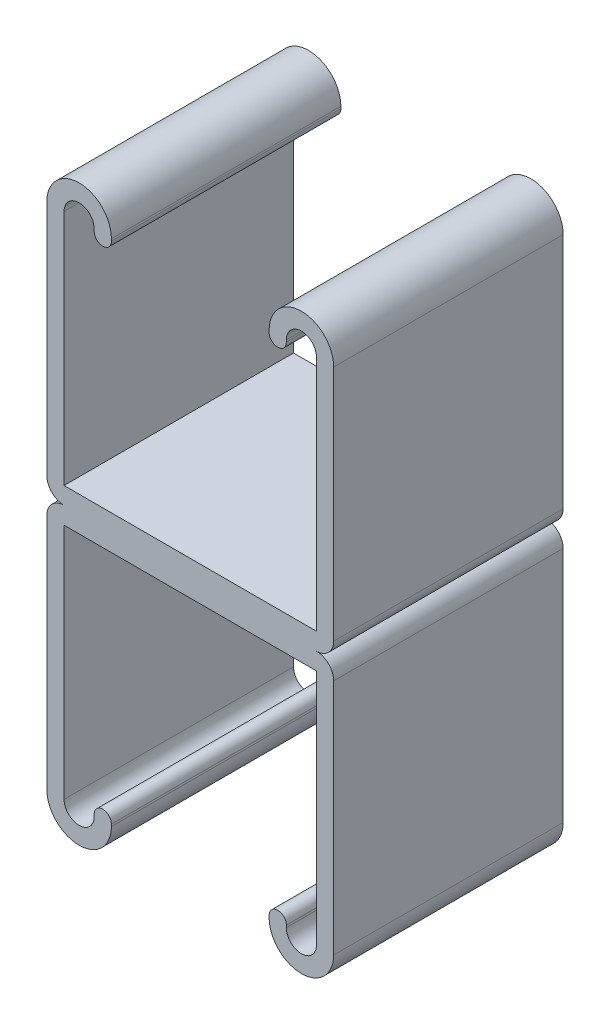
from build123d import *

# Parameters (mm, degrees)
BASE_EXTRUDE_DEPTH = 12.7


with BuildPart() as part:
    # Sketch1 → Base-Extrude (new, symmetric)
    with BuildSketch(Plane.XY):
        with BuildLine():
            Line((-15.875, 28.178125), (-15.875, 1.905))
            ThreePointArc((-15.875, 1.905), (-15.317038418, 0.557961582), (-13.97, 0))
            Line((-13.97, 0), (13.97, 0))
            ThreePointArc((13.97, 0), (15.317038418, 0.557961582), (15.875, 1.905))
            Line((15.875, 1.905), (15.875, 28.178125))
            ThreePointArc((15.875, 28.178125), (12.303125, 31.75), (8.73125, 28.178125))
            Line((8.73125, 28.178125), (8.73125, 27.94))
            ThreePointArc((8.73125, 27.94), (9.68375, 26.9875), (10.63625, 27.94))
            Line((10.63625, 27.94), (10.63625, 28.178125))
            ThreePointArc((10.63625, 28.178125), (12.303125, 29.845), (13.97, 28.178125))
            Line((13.97, 28.178125), (13.97, 1.905))
            Line((13.97, 1.905), (-13.97, 1.905))
            Line((-13.97, 1.905), (-13.97, 28.178125))
            ThreePointArc((-13.97, 28.178125), (-12.303125, 29.845), (-10.63625, 28.178125))
            Line((-10.63625, 28.178125), (-10.63625, 27.94))
            ThreePointArc((-10.63625, 27.94), (-9.68375, 26.9875), (-8.73125, 27.94))
            Line((-8.73125, 27.94), (-8.73125, 28.178125))
            ThreePointArc((-8.73125, 28.178125), (-12.303125, 31.75), (-15.875, 28.178125))
        make_face()
    base_extrude = extrude(amount=BASE_EXTRUDE_DEPTH, both=True)

    # Mirror1: Base-Extrude across plane
    add(base_extrude.mirror(Plane.ZX))


solid = part.part
